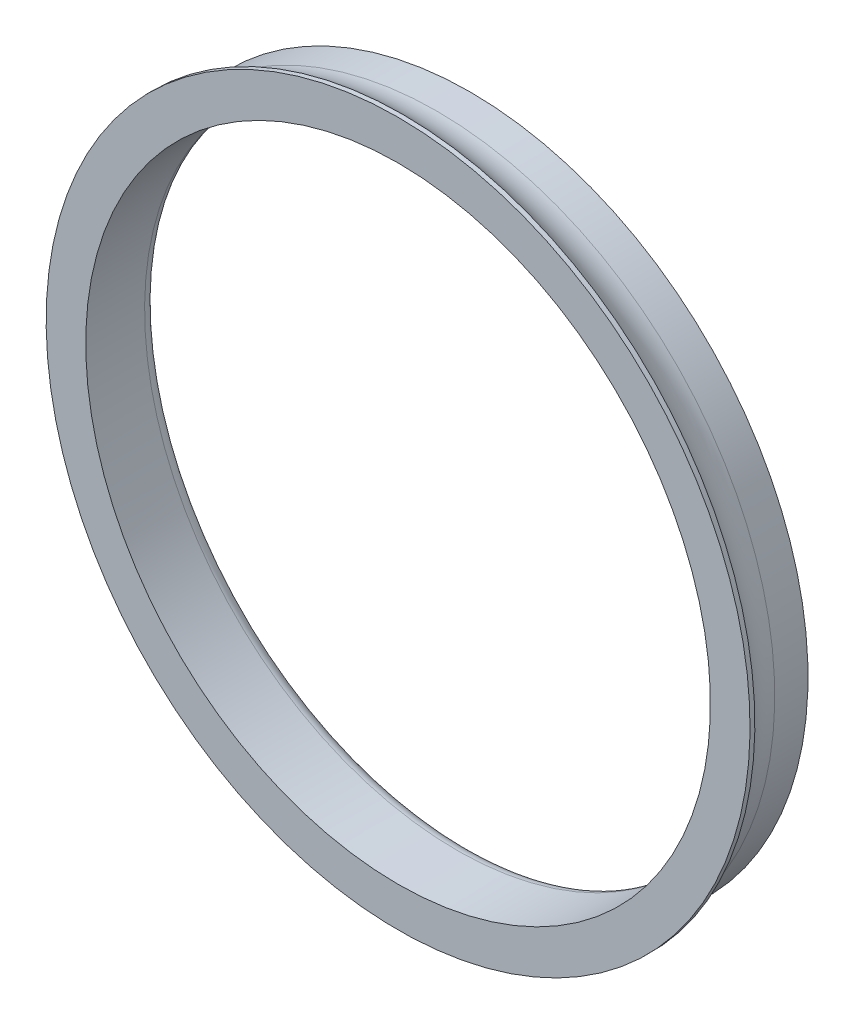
ISO-10303-21;
HEADER;
FILE_DESCRIPTION(('STEP AP214'),'2;1');
FILE_NAME('part.step','',(''),(''),'','','');
FILE_SCHEMA(('AUTOMOTIVE_DESIGN { 1 0 10303 214 1 1 1 1 }'));
ENDSEC;
DATA;
#1=APPLICATION_CONTEXT('core data for automotive mechanical design processes');
#2=APPLICATION_PROTOCOL_DEFINITION('international standard','automotive_design',2000,#1);
#3=PRODUCT_CONTEXT('',#1,'mechanical');
#4=PRODUCT('Part','Part','',(#3));
#5=PRODUCT_RELATED_PRODUCT_CATEGORY('part','',(#4));
#6=PRODUCT_DEFINITION_FORMATION('','',#4);
#7=PRODUCT_DEFINITION_CONTEXT('part definition',#1,'design');
#8=PRODUCT_DEFINITION('design','',#6,#7);
#9=PRODUCT_DEFINITION_SHAPE('','',#8);
#10=(LENGTH_UNIT() NAMED_UNIT(*) SI_UNIT(.MILLI.,.METRE.));
#11=(NAMED_UNIT(*) PLANE_ANGLE_UNIT() SI_UNIT($,.RADIAN.));
#12=(NAMED_UNIT(*) SI_UNIT($,.STERADIAN.) SOLID_ANGLE_UNIT());
#13=UNCERTAINTY_MEASURE_WITH_UNIT(LENGTH_MEASURE(1.E-05),#10,'distance_accuracy_value','');
#14=(GEOMETRIC_REPRESENTATION_CONTEXT(3) GLOBAL_UNCERTAINTY_ASSIGNED_CONTEXT((#13)) GLOBAL_UNIT_ASSIGNED_CONTEXT((#10,
#11,#12)) REPRESENTATION_CONTEXT('',''));
#15=CARTESIAN_POINT('',(0.,0.,0.));
#16=DIRECTION('',(0.,0.,1.));
#17=DIRECTION('',(1.,0.,0.));
#18=AXIS2_PLACEMENT_3D('',#15,#16,#17);
#19=CARTESIAN_POINT('',(0.,0.,71.3548216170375));
#20=DIRECTION('',(0.,0.,-1.));
#21=DIRECTION('',(0.,1.,0.));
#22=AXIS2_PLACEMENT_3D('',#19,#20,#21);
#23=CYLINDRICAL_SURFACE('',#22,7.03);
#24=CARTESIAN_POINT('',(0.,0.,18.0421647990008));
#25=DIRECTION('',(0.,0.,-1.));
#26=DIRECTION('',(-0.960132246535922,-0.27954618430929,0.));
#27=AXIS2_PLACEMENT_3D('',#24,#25,#26);
#28=CIRCLE('',#27,7.03);
#29=CARTESIAN_POINT('',(-6.74972969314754,-1.96520967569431,18.0421647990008));
#30=VERTEX_POINT('',#29);
#31=EDGE_CURVE('E26',#30,#30,#28,.T.);
#32=ORIENTED_EDGE('',*,*,#31,.T.);
#33=EDGE_LOOP('',(#32));
#34=FACE_BOUND('',#33,.T.);
#35=CARTESIAN_POINT('',(0.,0.,17.35));
#36=DIRECTION('',(0.,0.,-1.));
#37=DIRECTION('',(0.,1.,0.));
#38=AXIS2_PLACEMENT_3D('',#35,#36,#37);
#39=CIRCLE('',#38,7.03);
#40=CARTESIAN_POINT('',(0.,7.03,17.35));
#41=VERTEX_POINT('',#40);
#42=EDGE_CURVE('E15',#41,#41,#39,.F.);
#43=ORIENTED_EDGE('',*,*,#42,.T.);
#44=EDGE_LOOP('',(#43));
#45=FACE_BOUND('',#44,.T.);
#46=ADVANCED_FACE('F12',(#34,#45),#23,.T.);
#47=CARTESIAN_POINT('',(-6.74972969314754,-1.96520967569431,17.35));
#48=DIRECTION('',(0.,0.,1.));
#49=DIRECTION('',(0.,-1.,0.));
#50=AXIS2_PLACEMENT_3D('',#47,#48,#49);
#51=PLANE('',#50);
#52=CARTESIAN_POINT('',(0.,0.,17.35));
#53=DIRECTION('',(0.,0.,-1.));
#54=DIRECTION('',(-0.960132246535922,-0.27954618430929,0.));
#55=AXIS2_PLACEMENT_3D('',#52,#53,#54);
#56=CIRCLE('',#55,6.775);
#57=CARTESIAN_POINT('',(-6.50489597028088,-1.89392539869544,17.35));
#58=VERTEX_POINT('',#57);
#59=EDGE_CURVE('E29',#58,#58,#56,.T.);
#60=ORIENTED_EDGE('',*,*,#59,.F.);
#61=EDGE_LOOP('',(#60));
#62=FACE_BOUND('',#61,.T.);
#63=ORIENTED_EDGE('',*,*,#42,.F.);
#64=EDGE_LOOP('',(#63));
#65=FACE_BOUND('',#64,.T.);
#66=ADVANCED_FACE('F63',(#62,#65),#51,.F.);
#67=CARTESIAN_POINT('',(0.,0.,18.0421647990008));
#68=DIRECTION('',(0.,0.,-1.));
#69=DIRECTION('',(-0.960132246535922,-0.27954618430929,0.));
#70=AXIS2_PLACEMENT_3D('',#67,#68,#69);
#71=TOROIDAL_SURFACE('',#70,8.02986608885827,0.999866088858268);
#72=ORIENTED_EDGE('',*,*,#31,.F.);
#73=EDGE_LOOP('',(#72));
#74=FACE_BOUND('',#73,.T.);
#75=CARTESIAN_POINT('',(0.,0.,18.75));
#76=DIRECTION('',(0.,0.,-1.));
#77=DIRECTION('',(0.,1.,0.));
#78=AXIS2_PLACEMENT_3D('',#75,#76,#77);
#79=CIRCLE('',#78,7.32367806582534);
#80=CARTESIAN_POINT('',(0.,7.32367806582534,18.75));
#81=VERTEX_POINT('',#80);
#82=EDGE_CURVE('E56',#81,#81,#79,.F.);
#83=ORIENTED_EDGE('',*,*,#82,.F.);
#84=EDGE_LOOP('',(#83));
#85=FACE_BOUND('',#84,.T.);
#86=ADVANCED_FACE('F48',(#74,#85),#71,.F.);
#87=CARTESIAN_POINT('',(0.,0.,17.625));
#88=DIRECTION('',(0.,0.,-1.));
#89=DIRECTION('',(-0.960132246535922,-0.27954618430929,0.));
#90=AXIS2_PLACEMENT_3D('',#87,#88,#89);
#91=TOROIDAL_SURFACE('',#90,6.775,0.275);
#92=CARTESIAN_POINT('',(0.,0.,17.625));
#93=DIRECTION('',(0.,0.,-1.));
#94=DIRECTION('',(0.,1.,0.));
#95=AXIS2_PLACEMENT_3D('',#92,#93,#94);
#96=CIRCLE('',#95,6.5);
#97=CARTESIAN_POINT('',(0.,6.5,17.625));
#98=VERTEX_POINT('',#97);
#99=EDGE_CURVE('E24',#98,#98,#96,.F.);
#100=ORIENTED_EDGE('',*,*,#99,.T.);
#101=EDGE_LOOP('',(#100));
#102=FACE_BOUND('',#101,.T.);
#103=ORIENTED_EDGE('',*,*,#59,.T.);
#104=EDGE_LOOP('',(#103));
#105=FACE_BOUND('',#104,.T.);
#106=ADVANCED_FACE('F36',(#102,#105),#91,.T.);
#107=CARTESIAN_POINT('',(0.,0.,71.3548216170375));
#108=DIRECTION('',(0.,0.,-1.));
#109=DIRECTION('',(0.,1.,0.));
#110=AXIS2_PLACEMENT_3D('',#107,#108,#109);
#111=CYLINDRICAL_SURFACE('',#110,7.32367806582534);
#112=CARTESIAN_POINT('',(0.,0.,18.85));
#113=DIRECTION('',(0.,0.,-1.));
#114=DIRECTION('',(0.,1.,0.));
#115=AXIS2_PLACEMENT_3D('',#112,#113,#114);
#116=CIRCLE('',#115,7.32367806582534);
#117=CARTESIAN_POINT('',(0.,7.32367806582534,18.85));
#118=VERTEX_POINT('',#117);
#119=EDGE_CURVE('E19',#118,#118,#116,.T.);
#120=ORIENTED_EDGE('',*,*,#119,.T.);
#121=EDGE_LOOP('',(#120));
#122=FACE_BOUND('',#121,.T.);
#123=ORIENTED_EDGE('',*,*,#82,.T.);
#124=EDGE_LOOP('',(#123));
#125=FACE_BOUND('',#124,.T.);
#126=ADVANCED_FACE('F47',(#122,#125),#111,.T.);
#127=CARTESIAN_POINT('',(0.,0.,71.3548216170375));
#128=DIRECTION('',(0.,0.,-1.));
#129=DIRECTION('',(0.,1.,0.));
#130=AXIS2_PLACEMENT_3D('',#127,#128,#129);
#131=CYLINDRICAL_SURFACE('',#130,6.5);
#132=ORIENTED_EDGE('',*,*,#99,.F.);
#133=EDGE_LOOP('',(#132));
#134=FACE_BOUND('',#133,.T.);
#135=CARTESIAN_POINT('',(0.,0.,18.85));
#136=DIRECTION('',(0.,0.,-1.));
#137=DIRECTION('',(0.,1.,0.));
#138=AXIS2_PLACEMENT_3D('',#135,#136,#137);
#139=CIRCLE('',#138,6.5);
#140=CARTESIAN_POINT('',(0.,6.5,18.85));
#141=VERTEX_POINT('',#140);
#142=EDGE_CURVE('E8',#141,#141,#139,.F.);
#143=ORIENTED_EDGE('',*,*,#142,.T.);
#144=EDGE_LOOP('',(#143));
#145=FACE_BOUND('',#144,.T.);
#146=ADVANCED_FACE('F81',(#134,#145),#131,.F.);
#147=CARTESIAN_POINT('',(-6.2408596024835,-1.81705019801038,18.85));
#148=DIRECTION('',(0.,0.,-1.));
#149=DIRECTION('',(0.,1.,0.));
#150=AXIS2_PLACEMENT_3D('',#147,#148,#149);
#151=PLANE('',#150);
#152=ORIENTED_EDGE('',*,*,#142,.F.);
#153=EDGE_LOOP('',(#152));
#154=FACE_BOUND('',#153,.T.);
#155=ORIENTED_EDGE('',*,*,#119,.F.);
#156=EDGE_LOOP('',(#155));
#157=FACE_BOUND('',#156,.T.);
#158=ADVANCED_FACE('F79',(#154,#157),#151,.F.);
#159=CLOSED_SHELL('',(#46,#66,#86,#106,#126,#146,#158));
#160=MANIFOLD_SOLID_BREP('B1',#159);
#161=ADVANCED_BREP_SHAPE_REPRESENTATION('',(#18,#160),#14);
#162=SHAPE_DEFINITION_REPRESENTATION(#9,#161);
ENDSEC;
END-ISO-10303-21;
